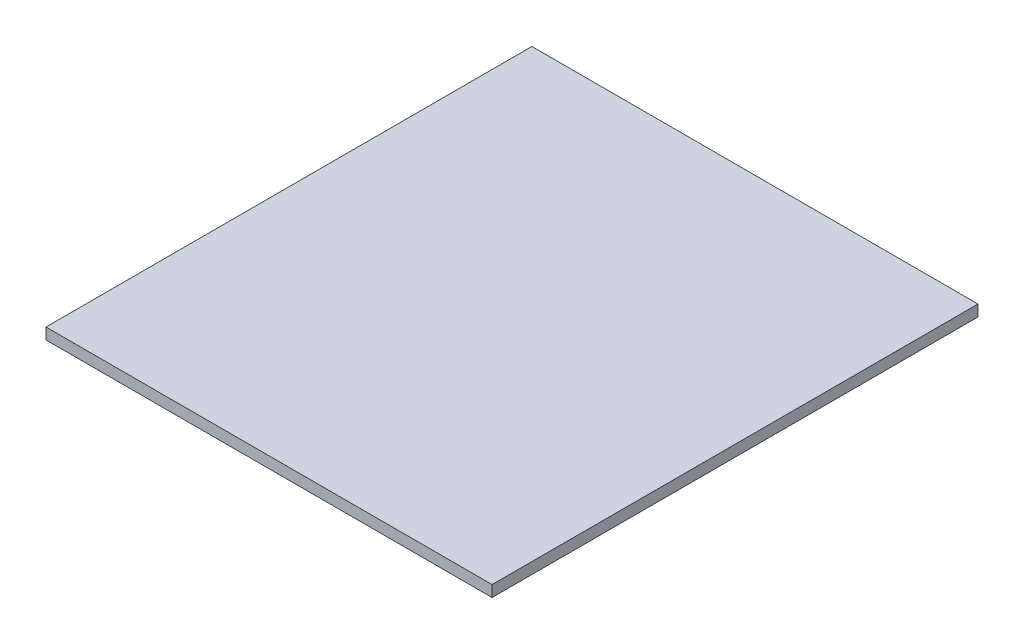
from build123d import *

# Parameters (mm, degrees)
SKETCH_1_W      = 79.5
SKETCH_1_H      = 86.6
EXTRUDE_1_DEPTH = 2


with BuildPart() as part:
    # Sketch 1 → Extrude 1 (new body)
    with BuildSketch(Plane(origin=(0, 0, 0), x_dir=(1, 0, 0), z_dir=(0, 1, 0))):
        Rectangle(SKETCH_1_W, SKETCH_1_H)
    extrude(amount=EXTRUDE_1_DEPTH)


solid = part.part
